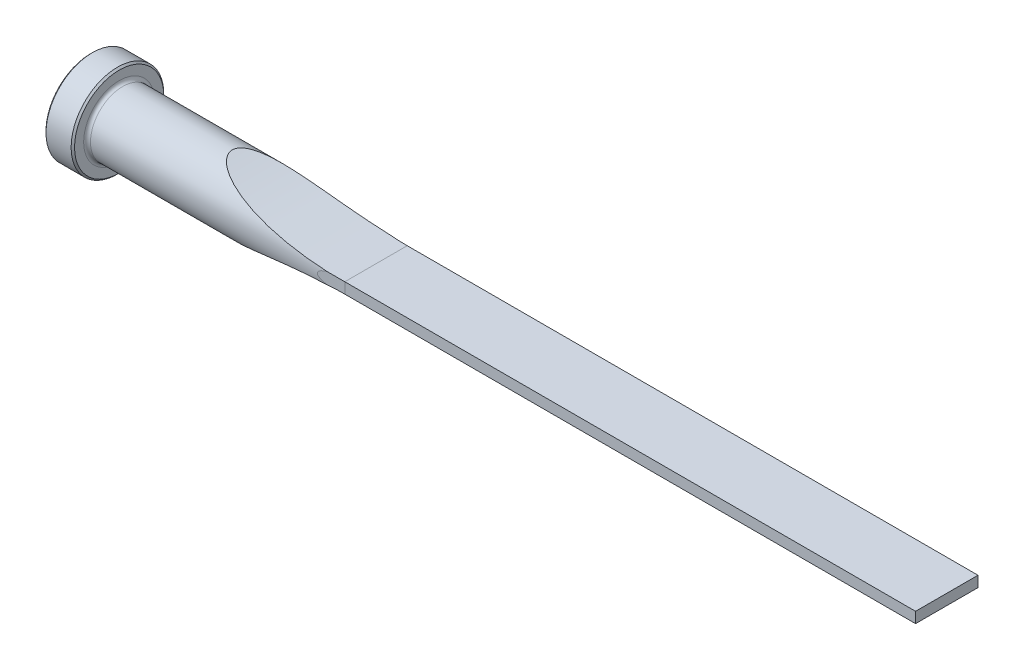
from build123d import *

# Parameters (mm, degrees)
CUT_EXTRUDE1_DEPTH = 192.05742903
CUT_EXTRUDE2_DEPTH = 192.05742913
FILLET1_R          = 0.762
CHAMFER1_SIZE      = 0.381


with BuildPart() as part:
    # Sketch1 → Revolve1 (revolve)
    with BuildSketch(Plane.XY, mode=Mode.PRIVATE) as revolve1_sk:
        Polygon((0, 0), (0, 10.3124), (6.35, 10.3124), (6.35, 7.14375), (190.5, 7.14375), (190.5, 0), align=None)
    revolve(revolve1_sk.sketch.rotate(Axis((0, 0, 0), (1, 0, 0)), 90), axis=Axis((0, 0, 0), (1, 0, 0)))

    # Sketch2 → Cut-Extrude1 (cut, symmetric)
    with BuildSketch(Plane.XY):
        with BuildLine():
            Line((190.5, 7.14375), (190.5, 1.1938))
            Line((190.5, 1.1938), (63.5, 1.1938))
            ThreePointArc((63.5, 1.1938), (47.237304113, 2.693944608), (31.52345852, 7.14375))
            Line((31.52345852, 7.14375), (190.5, 7.14375))
        make_face()
    cut_extrude1 = extrude(amount=CUT_EXTRUDE1_DEPTH, both=True, mode=Mode.SUBTRACT)

    # Mirror1: Cut-Extrude1 across plane
    add(cut_extrude1.mirror(Plane.ZX), mode=Mode.SUBTRACT)

    # Sketch3 → Cut-Extrude2 (cut, symmetric)
    with BuildSketch(Plane(origin=(0, 0, 0), x_dir=(1, 0, 0), z_dir=(0, 1, 0))):
        with BuildLine():
            Line((190.5, 7.14375), (190.5, 6.9469))
            Line((190.5, 6.9469), (63.5, 6.9469))
            ThreePointArc((63.5, 6.9469), (60.541963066, 6.996126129), (57.587202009, 7.14375))
            Line((57.587202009, 7.14375), (190.5, 7.14375))
        make_face()
    cut_extrude2 = extrude(amount=CUT_EXTRUDE2_DEPTH, both=True, mode=Mode.SUBTRACT)

    # Mirror2: Cut-Extrude2 across plane
    add(cut_extrude2.mirror(Plane.XY), mode=Mode.SUBTRACT)

    # Fillet1
    fillet1_edges = [part.edges().sort_by_distance(p)[0] for p in [
        (6.35, 0, -7.14375),
    ]]
    fillet(fillet1_edges, radius=FILLET1_R)

    # Chamfer1
    chamfer1_edges = [part.edges().sort_by_distance(p)[0] for p in [
        (6.35, 0, -10.3124),
        (0, 0, -10.3124),
    ]]
    chamfer(chamfer1_edges, length=CHAMFER1_SIZE)


solid = part.part
